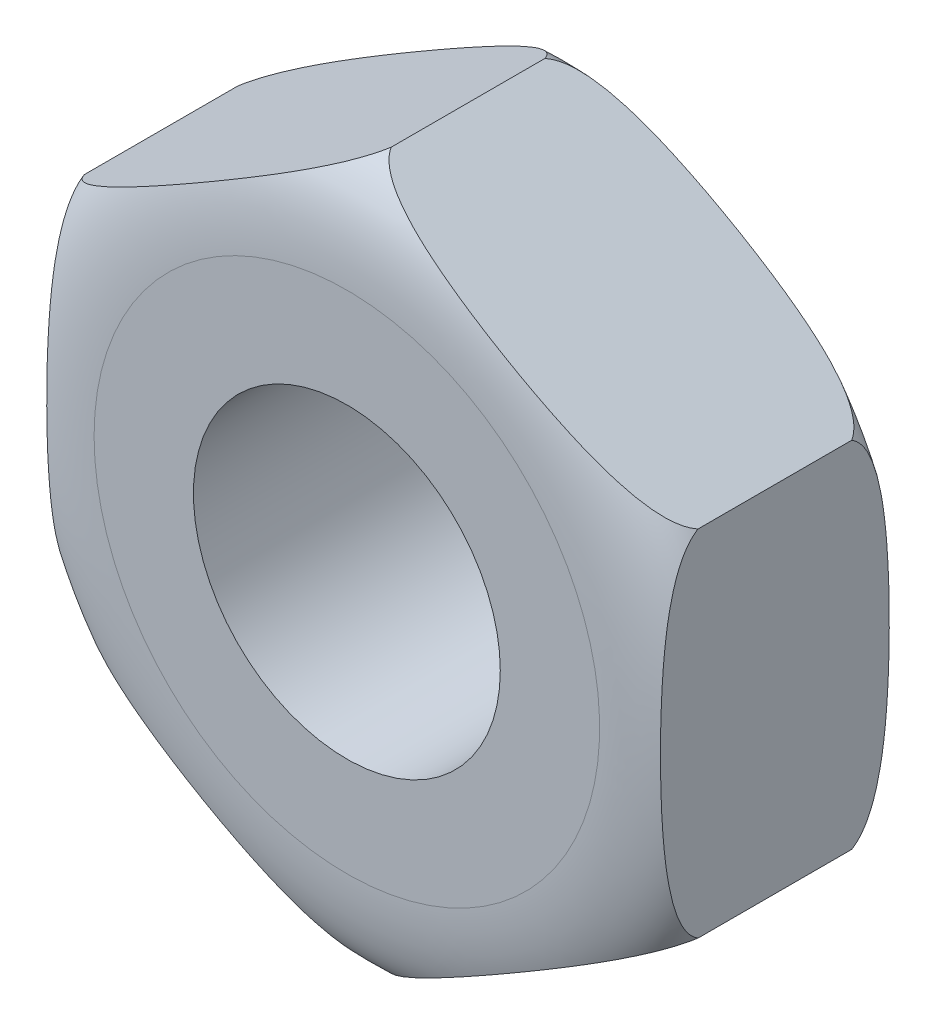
ISO-10303-21;
HEADER;
FILE_DESCRIPTION(('STEP AP214'),'2;1');
FILE_NAME('part.step','',(''),(''),'','','');
FILE_SCHEMA(('AUTOMOTIVE_DESIGN { 1 0 10303 214 1 1 1 1 }'));
ENDSEC;
DATA;
#1=APPLICATION_CONTEXT('core data for automotive mechanical design processes');
#2=APPLICATION_PROTOCOL_DEFINITION('international standard','automotive_design',2000,#1);
#3=PRODUCT_CONTEXT('',#1,'mechanical');
#4=PRODUCT('Part','Part','',(#3));
#5=PRODUCT_RELATED_PRODUCT_CATEGORY('part','',(#4));
#6=PRODUCT_DEFINITION_FORMATION('','',#4);
#7=PRODUCT_DEFINITION_CONTEXT('part definition',#1,'design');
#8=PRODUCT_DEFINITION('design','',#6,#7);
#9=PRODUCT_DEFINITION_SHAPE('','',#8);
#10=(LENGTH_UNIT() NAMED_UNIT(*) SI_UNIT(.MILLI.,.METRE.));
#11=(NAMED_UNIT(*) PLANE_ANGLE_UNIT() SI_UNIT($,.RADIAN.));
#12=(NAMED_UNIT(*) SI_UNIT($,.STERADIAN.) SOLID_ANGLE_UNIT());
#13=UNCERTAINTY_MEASURE_WITH_UNIT(LENGTH_MEASURE(1.E-05),#10,'distance_accuracy_value','');
#14=(GEOMETRIC_REPRESENTATION_CONTEXT(3) GLOBAL_UNCERTAINTY_ASSIGNED_CONTEXT((#13)) GLOBAL_UNIT_ASSIGNED_CONTEXT((#10,
#11,#12)) REPRESENTATION_CONTEXT('',''));
#15=CARTESIAN_POINT('',(0.,0.,0.));
#16=DIRECTION('',(0.,0.,1.));
#17=DIRECTION('',(1.,0.,0.));
#18=AXIS2_PLACEMENT_3D('',#15,#16,#17);
#19=CARTESIAN_POINT('',(-1.9,3.29089653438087,1.5));
#20=DIRECTION('',(0.,0.,1.));
#21=DIRECTION('',(1.,0.,0.));
#22=AXIS2_PLACEMENT_3D('',#19,#20,#21);
#23=PLANE('',#22);
#24=CARTESIAN_POINT('',(0.,0.,1.5));
#25=DIRECTION('',(0.,0.,1.));
#26=DIRECTION('',(1.,0.,0.));
#27=AXIS2_PLACEMENT_3D('',#24,#25,#26);
#28=CIRCLE('',#27,0.95);
#29=CARTESIAN_POINT('',(0.95,0.,1.5));
#30=VERTEX_POINT('',#29);
#31=EDGE_CURVE('E264',#30,#30,#28,.T.);
#32=ORIENTED_EDGE('',*,*,#31,.F.);
#33=EDGE_LOOP('',(#32));
#34=FACE_BOUND('',#33,.T.);
#35=CARTESIAN_POINT('',(0.,0.,1.5));
#36=DIRECTION('',(0.,0.,-1.));
#37=DIRECTION('',(-1.,0.,0.));
#38=AXIS2_PLACEMENT_3D('',#35,#36,#37);
#39=CIRCLE('',#38,1.56505143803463);
#40=CARTESIAN_POINT('',(-1.56505143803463,0.,1.5));
#41=VERTEX_POINT('',#40);
#42=EDGE_CURVE('E204',#41,#41,#39,.T.);
#43=ORIENTED_EDGE('',*,*,#42,.F.);
#44=EDGE_LOOP('',(#43));
#45=FACE_BOUND('',#44,.T.);
#46=ADVANCED_FACE('F49',(#34,#45),#23,.T.);
#47=CARTESIAN_POINT('',(-1.9,3.29089653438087,0.));
#48=DIRECTION('',(0.,0.,1.));
#49=DIRECTION('',(1.,0.,0.));
#50=AXIS2_PLACEMENT_3D('',#47,#48,#49);
#51=PLANE('',#50);
#52=CARTESIAN_POINT('',(0.,0.,0.));
#53=DIRECTION('',(0.,0.,1.));
#54=DIRECTION('',(1.,0.,0.));
#55=AXIS2_PLACEMENT_3D('',#52,#53,#54);
#56=CIRCLE('',#55,0.95);
#57=CARTESIAN_POINT('',(0.95,0.,0.));
#58=VERTEX_POINT('',#57);
#59=EDGE_CURVE('E267',#58,#58,#56,.T.);
#60=ORIENTED_EDGE('',*,*,#59,.T.);
#61=EDGE_LOOP('',(#60));
#62=FACE_BOUND('',#61,.T.);
#63=CARTESIAN_POINT('',(0.,0.,0.));
#64=DIRECTION('',(0.,0.,-1.));
#65=DIRECTION('',(-1.,0.,0.));
#66=AXIS2_PLACEMENT_3D('',#63,#64,#65);
#67=CIRCLE('',#66,1.56505143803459);
#68=CARTESIAN_POINT('',(-1.56505143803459,0.,0.));
#69=VERTEX_POINT('',#68);
#70=EDGE_CURVE('E269',#69,#69,#67,.T.);
#71=ORIENTED_EDGE('',*,*,#70,.T.);
#72=EDGE_LOOP('',(#71));
#73=FACE_BOUND('',#72,.T.);
#74=ADVANCED_FACE('F250',(#62,#73),#51,.F.);
#75=CARTESIAN_POINT('',(0.,0.,1.5));
#76=DIRECTION('',(0.,0.,-1.));
#77=DIRECTION('',(-1.,0.,0.));
#78=AXIS2_PLACEMENT_3D('',#75,#76,#77);
#79=CYLINDRICAL_SURFACE('',#78,0.95);
#80=ORIENTED_EDGE('',*,*,#31,.T.);
#81=EDGE_LOOP('',(#80));
#82=FACE_BOUND('',#81,.T.);
#83=ORIENTED_EDGE('',*,*,#59,.F.);
#84=EDGE_LOOP('',(#83));
#85=FACE_BOUND('',#84,.T.);
#86=ADVANCED_FACE('F157',(#82,#85),#79,.F.);
#87=CARTESIAN_POINT('',(1.31612393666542,-0.759864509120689,1.5));
#88=CARTESIAN_POINT('',(1.54865745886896,-0.894117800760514,1.50318208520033));
#89=CARTESIAN_POINT('',(1.84134953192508,-1.06310364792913,1.45126725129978));
#90=CARTESIAN_POINT('',(1.9,-1.09696551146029,1.22554803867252));
#91=B_SPLINE_CURVE_WITH_KNOTS('',3,(#87,#88,#89,#90),.UNSPECIFIED.,.F.,.F.,(4,4),(0.,1.),.UNSPECIFIED.);
#92=CARTESIAN_POINT('',(0.,0.,0.));
#93=DIRECTION('',(0.,0.,-1.));
#94=AXIS1_PLACEMENT('',#92,#93);
#95=SURFACE_OF_REVOLUTION('',#91,#94);
#96=ORIENTED_EDGE('',*,*,#42,.T.);
#97=EDGE_LOOP('',(#96));
#98=FACE_BOUND('',#97,.T.);
#99=CARTESIAN_POINT('',(-1.9,1.09696551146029,1.22554803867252));
#100=CARTESIAN_POINT('',(-1.89309947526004,1.10094953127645,1.23879320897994));
#101=CARTESIAN_POINT('',(-1.88486263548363,1.10570507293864,1.25087507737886));
#102=CARTESIAN_POINT('',(-1.86669810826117,1.11619236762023,1.27278402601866));
#103=CARTESIAN_POINT('',(-1.85680752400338,1.12190269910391,1.28265136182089));
#104=CARTESIAN_POINT('',(-1.82985805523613,1.13746198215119,1.30601397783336));
#105=CARTESIAN_POINT('',(-1.81200195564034,1.1477712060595,1.31823425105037));
#106=CARTESIAN_POINT('',(-1.78422002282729,1.16381111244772,1.334420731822));
#107=CARTESIAN_POINT('',(-1.77473201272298,1.16928901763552,1.33948310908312));
#108=CARTESIAN_POINT('',(-1.7555227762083,1.1803794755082,1.34897730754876));
#109=CARTESIAN_POINT('',(-1.74580163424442,1.18599197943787,1.35340935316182));
#110=CARTESIAN_POINT('',(-1.7160739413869,1.20315527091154,1.36605534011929));
#111=CARTESIAN_POINT('',(-1.69580840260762,1.21485558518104,1.37345069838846));
#112=CARTESIAN_POINT('',(-1.6548935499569,1.23847778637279,1.3866805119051));
#113=CARTESIAN_POINT('',(-1.63424389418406,1.25039987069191,1.39251349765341));
#114=CARTESIAN_POINT('',(-1.57184811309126,1.28642409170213,1.40829693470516));
#115=CARTESIAN_POINT('',(-1.52977245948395,1.31071648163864,1.41648810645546));
#116=CARTESIAN_POINT('',(-1.44498482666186,1.35966864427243,1.43005022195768));
#117=CARTESIAN_POINT('',(-1.40227044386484,1.38432980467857,1.43539868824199));
#118=CARTESIAN_POINT('',(-1.31679277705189,1.4336803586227,1.44409236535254));
#119=CARTESIAN_POINT('',(-1.27402983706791,1.45836955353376,1.44744220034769));
#120=CARTESIAN_POINT('',(-1.17475914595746,1.51568351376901,1.45353825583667));
#121=CARTESIAN_POINT('',(-1.11822806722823,1.54832174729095,1.45574908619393));
#122=CARTESIAN_POINT('',(-1.00506171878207,1.61365836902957,1.45824920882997));
#123=CARTESIAN_POINT('',(-0.948426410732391,1.64635677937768,1.45853593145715));
#124=CARTESIAN_POINT('',(-0.834986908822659,1.711851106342,1.45724580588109));
#125=CARTESIAN_POINT('',(-0.77818276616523,1.74464699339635,1.45566288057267));
#126=CARTESIAN_POINT('',(-0.665445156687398,1.80973608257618,1.45026116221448));
#127=CARTESIAN_POINT('',(-0.609510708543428,1.84202985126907,1.446474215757));
#128=CARTESIAN_POINT('',(-0.525853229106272,1.89032951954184,1.43835806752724));
#129=CARTESIAN_POINT('',(-0.498042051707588,1.90638631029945,1.43525202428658));
#130=CARTESIAN_POINT('',(-0.442523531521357,1.93843994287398,1.42799646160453));
#131=CARTESIAN_POINT('',(-0.41481617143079,1.9544367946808,1.42384712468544));
#132=CARTESIAN_POINT('',(-0.359688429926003,1.98626481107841,1.41419685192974));
#133=CARTESIAN_POINT('',(-0.332267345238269,2.00209638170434,1.40870136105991));
#134=CARTESIAN_POINT('',(-0.277757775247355,2.03356749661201,1.39585807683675));
#135=CARTESIAN_POINT('',(-0.250669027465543,2.04920719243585,1.38851185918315));
#136=CARTESIAN_POINT('',(-0.214134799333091,2.07030023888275,1.37665326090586));
#137=CARTESIAN_POINT('',(-0.204407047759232,2.07591655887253,1.37330293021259));
#138=CARTESIAN_POINT('',(-0.185066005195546,2.08708311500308,1.36617975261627));
#139=CARTESIAN_POINT('',(-0.175452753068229,2.09263332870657,1.36240676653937));
#140=CARTESIAN_POINT('',(-0.146791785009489,2.10918074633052,1.35033506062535));
#141=CARTESIAN_POINT('',(-0.127962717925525,2.12005171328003,1.34129590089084));
#142=CARTESIAN_POINT('',(-0.0957617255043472,2.13864296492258,1.32289628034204));
#143=CARTESIAN_POINT('',(-0.0821471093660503,2.14650336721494,1.31411038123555));
#144=CARTESIAN_POINT('',(-0.0561817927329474,2.16149444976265,1.2944332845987));
#145=CARTESIAN_POINT('',(-0.0438228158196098,2.16862990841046,1.28355745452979));
#146=CARTESIAN_POINT('',(-0.0263145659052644,2.17873830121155,1.26459186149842));
#147=CARTESIAN_POINT('',(-0.0204159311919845,2.18214387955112,1.25743692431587));
#148=CARTESIAN_POINT('',(-0.00947560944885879,2.18846027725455,1.24219596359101));
#149=CARTESIAN_POINT('',(-0.00444235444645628,2.19136622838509,1.23410193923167));
#150=CARTESIAN_POINT('',(0.,2.19393102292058,1.22554803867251));
#151=B_SPLINE_CURVE_WITH_KNOTS('',3,(#99,#100,#101,#102,#103,#104,#105,#106,#107,#108,#109,#110,
#111,#112,#113,#114,#115,#116,#117,#118,#119,#120,#121,#122,#123,#124,#125,#126,#127,#128,#129,
#130,#131,#132,#133,#134,#135,#136,#137,#138,#139,#140,#141,#142,#143,#144,#145,#146,#147,#148,
#149,#150),.UNSPECIFIED.,.F.,.F.,(4,2,2,2,2,2,2,2,2,2,2,2,2,2,2,2,2,2,2,2,2,2,2,2,2,4),(0.,
0.0459613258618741,0.0910036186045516,0.1625119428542,0.198711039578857,0.23489721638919,
0.308436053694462,0.382043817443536,0.529684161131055,0.678475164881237,0.826920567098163,
1.02282582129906,1.21899265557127,1.41579886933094,1.60982958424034,1.70660791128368,
1.80336931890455,1.89974562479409,1.99604015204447,2.03119717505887,2.06636580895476,
2.13684567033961,2.19076479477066,2.24430165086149,2.27385275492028,2.30367722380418),.UNSPECIFIED.);
#152=CARTESIAN_POINT('',(-1.9,1.09696551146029,1.22554803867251));
#153=VERTEX_POINT('',#152);
#154=CARTESIAN_POINT('',(0.,2.19393102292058,1.22554803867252));
#155=VERTEX_POINT('',#154);
#156=EDGE_CURVE('E107',#153,#155,#151,.T.);
#157=ORIENTED_EDGE('',*,*,#156,.F.);
#158=CARTESIAN_POINT('',(-1.9,-1.09696551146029,1.22554803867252));
#159=CARTESIAN_POINT('',(-1.9,-1.08899747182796,1.23879320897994));
#160=CARTESIAN_POINT('',(-1.9,-1.07948638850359,1.25087507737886));
#161=CARTESIAN_POINT('',(-1.9,-1.05851179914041,1.27278402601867));
#162=CARTESIAN_POINT('',(-1.9,-1.04709113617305,1.28265136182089));
#163=CARTESIAN_POINT('',(-1.9,-1.01597257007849,1.30601397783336));
#164=CARTESIAN_POINT('',(-1.9,-0.995354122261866,1.31823425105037));
#165=CARTESIAN_POINT('',(-1.9,-0.963274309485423,1.33442073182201));
#166=CARTESIAN_POINT('',(-1.9,-0.952318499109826,1.33948310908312));
#167=CARTESIAN_POINT('',(-1.9,-0.930137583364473,1.34897730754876));
#168=CARTESIAN_POINT('',(-1.9,-0.918912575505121,1.35340935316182));
#169=CARTESIAN_POINT('',(-1.89999999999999,-0.884585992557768,1.36605534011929));
#170=CARTESIAN_POINT('',(-1.9,-0.861185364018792,1.37345069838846));
#171=CARTESIAN_POINT('',(-1.9,-0.813940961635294,1.3866805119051));
#172=CARTESIAN_POINT('',(-1.9,-0.790096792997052,1.39251349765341));
#173=CARTESIAN_POINT('',(-1.9,-0.718048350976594,1.40829693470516));
#174=CARTESIAN_POINT('',(-1.9,-0.669463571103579,1.41648810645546));
#175=CARTESIAN_POINT('',(-1.9,-0.571559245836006,1.43005022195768));
#176=CARTESIAN_POINT('',(-1.90000000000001,-0.522236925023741,1.43539868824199));
#177=CARTESIAN_POINT('',(-1.89999999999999,-0.423535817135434,1.44409236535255));
#178=CARTESIAN_POINT('',(-1.89999999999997,-0.374157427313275,1.44744220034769));
#179=CARTESIAN_POINT('',(-1.89999999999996,-0.259529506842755,1.45353825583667));
#180=CARTESIAN_POINT('',(-1.89999999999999,-0.194253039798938,1.45574908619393));
#181=CARTESIAN_POINT('',(-1.90000000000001,-0.0635797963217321,1.45824920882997));
#182=CARTESIAN_POINT('',(-1.9,0.00181702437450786,1.45853593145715));
#183=CARTESIAN_POINT('',(-1.9,0.132805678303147,1.45724580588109));
#184=CARTESIAN_POINT('',(-1.9,0.198397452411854,1.45566288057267));
#185=CARTESIAN_POINT('',(-1.9,0.328575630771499,1.45026116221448));
#186=CARTESIAN_POINT('',(-1.9,0.393163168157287,1.446474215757));
#187=CARTESIAN_POINT('',(-1.9,0.489762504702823,1.43835806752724));
#188=CARTESIAN_POINT('',(-1.9,0.521876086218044,1.43525202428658));
#189=CARTESIAN_POINT('',(-1.9,0.585983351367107,1.42799646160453));
#190=CARTESIAN_POINT('',(-1.9,0.617977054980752,1.42384712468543));
#191=CARTESIAN_POINT('',(-1.9,0.681633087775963,1.41419685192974));
#192=CARTESIAN_POINT('',(-1.9,0.713296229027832,1.40870136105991));
#193=CARTESIAN_POINT('',(-1.9,0.776238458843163,1.39585807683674));
#194=CARTESIAN_POINT('',(-1.9,0.807517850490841,1.38851185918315));
#195=CARTESIAN_POINT('',(-1.9,0.849703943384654,1.37665326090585));
#196=CARTESIAN_POINT('',(-1.9,0.860936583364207,1.37330293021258));
#197=CARTESIAN_POINT('',(-1.9,0.88326969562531,1.36617975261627));
#198=CARTESIAN_POINT('',(-1.9,0.894370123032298,1.36240676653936));
#199=CARTESIAN_POINT('',(-1.9,0.927464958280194,1.35033506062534));
#200=CARTESIAN_POINT('',(-1.89999999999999,0.949206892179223,1.34129590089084));
#201=CARTESIAN_POINT('',(-1.9,0.986389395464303,1.32289628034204));
#202=CARTESIAN_POINT('',(-1.9,1.00211020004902,1.31411038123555));
#203=CARTESIAN_POINT('',(-1.9,1.03209236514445,1.29443328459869));
#204=CARTESIAN_POINT('',(-1.89999999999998,1.04636328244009,1.28355745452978));
#205=CARTESIAN_POINT('',(-1.89999999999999,1.06658006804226,1.26459186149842));
#206=CARTESIAN_POINT('',(-1.9,1.07339122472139,1.25743692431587));
#207=CARTESIAN_POINT('',(-1.90000000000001,1.08602402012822,1.24219596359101));
#208=CARTESIAN_POINT('',(-1.90000000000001,1.0918359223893,1.23410193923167));
#209=CARTESIAN_POINT('',(-1.9,1.09696551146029,1.22554803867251));
#210=B_SPLINE_CURVE_WITH_KNOTS('',3,(#158,#159,#160,#161,#162,#163,#164,#165,#166,#167,#168,
#169,#170,#171,#172,#173,#174,#175,#176,#177,#178,#179,#180,#181,#182,#183,#184,#185,#186,#187,
#188,#189,#190,#191,#192,#193,#194,#195,#196,#197,#198,#199,#200,#201,#202,#203,#204,#205,#206,
#207,#208,#209),.UNSPECIFIED.,.F.,.F.,(4,2,2,2,2,2,2,2,2,2,2,2,2,2,2,2,2,2,2,2,2,2,2,2,2,4),(0.,
0.0459613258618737,0.0910036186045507,0.1625119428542,0.198711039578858,0.234897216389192,
0.308436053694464,0.38204381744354,0.529684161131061,0.678475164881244,0.826920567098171,
1.02282582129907,1.21899265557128,1.41579886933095,1.60982958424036,1.70660791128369,
1.80336931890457,1.89974562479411,1.99604015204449,2.03119717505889,2.06636580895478,
2.13684567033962,2.19076479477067,2.2443016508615,2.27385275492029,2.30367722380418),.UNSPECIFIED.);
#211=CARTESIAN_POINT('',(-1.9,-1.09696551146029,1.22554803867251));
#212=VERTEX_POINT('',#211);
#213=EDGE_CURVE('E110',#212,#153,#210,.T.);
#214=ORIENTED_EDGE('',*,*,#213,.F.);
#215=CARTESIAN_POINT('',(0.,-2.19393102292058,1.22554803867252));
#216=CARTESIAN_POINT('',(-0.00690052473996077,-2.18994700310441,1.23879320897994));
#217=CARTESIAN_POINT('',(-0.0151373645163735,-2.18519146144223,1.25087507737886));
#218=CARTESIAN_POINT('',(-0.0333018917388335,-2.17470416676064,1.27278402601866));
#219=CARTESIAN_POINT('',(-0.0431924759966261,-2.16899383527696,1.28265136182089));
#220=CARTESIAN_POINT('',(-0.0701419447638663,-2.15343455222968,1.30601397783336));
#221=CARTESIAN_POINT('',(-0.0879980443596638,-2.14312532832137,1.31823425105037));
#222=CARTESIAN_POINT('',(-0.115779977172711,-2.12708542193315,1.33442073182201));
#223=CARTESIAN_POINT('',(-0.125267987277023,-2.12160751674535,1.33948310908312));
#224=CARTESIAN_POINT('',(-0.1444772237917,-2.11051705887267,1.34897730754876));
#225=CARTESIAN_POINT('',(-0.154198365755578,-2.10490455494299,1.35340935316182));
#226=CARTESIAN_POINT('',(-0.183926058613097,-2.08774126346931,1.36605534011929));
#227=CARTESIAN_POINT('',(-0.204191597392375,-2.07604094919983,1.37345069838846));
#228=CARTESIAN_POINT('',(-0.245106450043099,-2.05241874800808,1.3866805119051));
#229=CARTESIAN_POINT('',(-0.265756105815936,-2.04049666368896,1.39251349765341));
#230=CARTESIAN_POINT('',(-0.328151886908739,-2.00447244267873,1.40829693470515));
#231=CARTESIAN_POINT('',(-0.370227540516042,-1.98018005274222,1.41648810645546));
#232=CARTESIAN_POINT('',(-0.455015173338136,-1.93122789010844,1.43005022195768));
#233=CARTESIAN_POINT('',(-0.497729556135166,-1.90656672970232,1.43539868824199));
#234=CARTESIAN_POINT('',(-0.583207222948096,-1.85721617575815,1.44409236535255));
#235=CARTESIAN_POINT('',(-0.625970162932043,-1.83252698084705,1.44744220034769));
#236=CARTESIAN_POINT('',(-0.725240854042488,-1.77521302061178,1.45353825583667));
#237=CARTESIAN_POINT('',(-0.781771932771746,-1.7425747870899,1.45574908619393));
#238=CARTESIAN_POINT('',(-0.894938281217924,-1.67723816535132,1.45824920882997));
#239=CARTESIAN_POINT('',(-0.951573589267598,-1.6445397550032,1.45853593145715));
#240=CARTESIAN_POINT('',(-1.06501309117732,-1.57904542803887,1.45724580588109));
#241=CARTESIAN_POINT('',(-1.12181723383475,-1.54624954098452,1.45566288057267));
#242=CARTESIAN_POINT('',(-1.23455484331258,-1.4811604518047,1.45026116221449));
#243=CARTESIAN_POINT('',(-1.29048929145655,-1.44886668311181,1.446474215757));
#244=CARTESIAN_POINT('',(-1.3741467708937,-1.40056701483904,1.43835806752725));
#245=CARTESIAN_POINT('',(-1.40195794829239,-1.38451022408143,1.43525202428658));
#246=CARTESIAN_POINT('',(-1.45747646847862,-1.3524565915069,1.42799646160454));
#247=CARTESIAN_POINT('',(-1.48518382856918,-1.33645973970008,1.42384712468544));
#248=CARTESIAN_POINT('',(-1.54031157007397,-1.30463172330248,1.41419685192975));
#249=CARTESIAN_POINT('',(-1.5677326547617,-1.28880015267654,1.40870136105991));
#250=CARTESIAN_POINT('',(-1.62224222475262,-1.25732903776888,1.39585807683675));
#251=CARTESIAN_POINT('',(-1.64933097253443,-1.24168934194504,1.38851185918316));
#252=CARTESIAN_POINT('',(-1.68586520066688,-1.22059629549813,1.37665326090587));
#253=CARTESIAN_POINT('',(-1.69559295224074,-1.21497997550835,1.3733029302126));
#254=CARTESIAN_POINT('',(-1.71493399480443,-1.2038134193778,1.36617975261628));
#255=CARTESIAN_POINT('',(-1.72454724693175,-1.19826320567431,1.36240676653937));
#256=CARTESIAN_POINT('',(-1.75320821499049,-1.18171578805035,1.35033506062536));
#257=CARTESIAN_POINT('',(-1.77203728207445,-1.17084482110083,1.34129590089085));
#258=CARTESIAN_POINT('',(-1.80423827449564,-1.15225356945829,1.32289628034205));
#259=CARTESIAN_POINT('',(-1.81785289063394,-1.14439316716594,1.31411038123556));
#260=CARTESIAN_POINT('',(-1.84381820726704,-1.12940208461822,1.29443328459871));
#261=CARTESIAN_POINT('',(-1.85617718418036,-1.12226662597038,1.2835574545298));
#262=CARTESIAN_POINT('',(-1.87368543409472,-1.1121582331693,1.26459186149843));
#263=CARTESIAN_POINT('',(-1.879584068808,-1.10875265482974,1.25743692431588));
#264=CARTESIAN_POINT('',(-1.89052439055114,-1.10243625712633,1.24219596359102));
#265=CARTESIAN_POINT('',(-1.89555764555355,-1.09953030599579,1.23410193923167));
#266=CARTESIAN_POINT('',(-1.9,-1.09696551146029,1.22554803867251));
#267=B_SPLINE_CURVE_WITH_KNOTS('',3,(#215,#216,#217,#218,#219,#220,#221,#222,#223,#224,#225,
#226,#227,#228,#229,#230,#231,#232,#233,#234,#235,#236,#237,#238,#239,#240,#241,#242,#243,#244,
#245,#246,#247,#248,#249,#250,#251,#252,#253,#254,#255,#256,#257,#258,#259,#260,#261,#262,#263,
#264,#265,#266),.UNSPECIFIED.,.F.,.F.,(4,2,2,2,2,2,2,2,2,2,2,2,2,2,2,2,2,2,2,2,2,2,2,2,2,4),(0.,
0.0459613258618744,0.0910036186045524,0.162511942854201,0.198711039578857,0.23489721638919,
0.308436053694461,0.382043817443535,0.529684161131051,0.67847516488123,0.826920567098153,
1.02282582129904,1.21899265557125,1.41579886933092,1.60982958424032,1.70660791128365,
1.80336931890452,1.89974562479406,1.99604015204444,2.03119717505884,2.06636580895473,
2.13684567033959,2.19076479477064,2.24430165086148,2.27385275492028,2.30367722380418),.UNSPECIFIED.);
#268=CARTESIAN_POINT('',(0.,-2.19393102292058,1.22554803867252));
#269=VERTEX_POINT('',#268);
#270=EDGE_CURVE('E129',#269,#212,#267,.T.);
#271=ORIENTED_EDGE('',*,*,#270,.F.);
#272=CARTESIAN_POINT('',(1.9,-1.09696551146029,1.22554803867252));
#273=CARTESIAN_POINT('',(1.89309947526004,-1.10094953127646,1.23879320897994));
#274=CARTESIAN_POINT('',(1.88486263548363,-1.10570507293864,1.25087507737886));
#275=CARTESIAN_POINT('',(1.86669810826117,-1.11619236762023,1.27278402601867));
#276=CARTESIAN_POINT('',(1.85680752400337,-1.12190269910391,1.28265136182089));
#277=CARTESIAN_POINT('',(1.82985805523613,-1.13746198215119,1.30601397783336));
#278=CARTESIAN_POINT('',(1.81200195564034,-1.1477712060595,1.31823425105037));
#279=CARTESIAN_POINT('',(1.78422002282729,-1.16381111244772,1.33442073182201));
#280=CARTESIAN_POINT('',(1.77473201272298,-1.16928901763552,1.33948310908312));
#281=CARTESIAN_POINT('',(1.7555227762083,-1.1803794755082,1.34897730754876));
#282=CARTESIAN_POINT('',(1.74580163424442,-1.18599197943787,1.35340935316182));
#283=CARTESIAN_POINT('',(1.7160739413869,-1.20315527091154,1.36605534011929));
#284=CARTESIAN_POINT('',(1.69580840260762,-1.21485558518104,1.37345069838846));
#285=CARTESIAN_POINT('',(1.6548935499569,-1.23847778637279,1.3866805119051));
#286=CARTESIAN_POINT('',(1.63424389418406,-1.25039987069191,1.39251349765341));
#287=CARTESIAN_POINT('',(1.57184811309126,-1.28642409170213,1.40829693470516));
#288=CARTESIAN_POINT('',(1.52977245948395,-1.31071648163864,1.41648810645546));
#289=CARTESIAN_POINT('',(1.44498482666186,-1.35966864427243,1.43005022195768));
#290=CARTESIAN_POINT('',(1.40227044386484,-1.38432980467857,1.43539868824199));
#291=CARTESIAN_POINT('',(1.31679277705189,-1.4336803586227,1.44409236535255));
#292=CARTESIAN_POINT('',(1.27402983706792,-1.45836955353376,1.44744220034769));
#293=CARTESIAN_POINT('',(1.17475914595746,-1.51568351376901,1.45353825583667));
#294=CARTESIAN_POINT('',(1.11822806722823,-1.54832174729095,1.45574908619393));
#295=CARTESIAN_POINT('',(1.00506171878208,-1.61365836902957,1.45824920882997));
#296=CARTESIAN_POINT('',(0.948426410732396,-1.64635677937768,1.45853593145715));
#297=CARTESIAN_POINT('',(0.834986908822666,-1.71185110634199,1.45724580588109));
#298=CARTESIAN_POINT('',(0.778182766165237,-1.74464699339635,1.45566288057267));
#299=CARTESIAN_POINT('',(0.665445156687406,-1.80973608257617,1.45026116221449));
#300=CARTESIAN_POINT('',(0.609510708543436,-1.84202985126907,1.446474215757));
#301=CARTESIAN_POINT('',(0.525853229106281,-1.89032951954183,1.43835806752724));
#302=CARTESIAN_POINT('',(0.498042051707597,-1.90638631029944,1.43525202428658));
#303=CARTESIAN_POINT('',(0.442523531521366,-1.93843994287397,1.42799646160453));
#304=CARTESIAN_POINT('',(0.4148161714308,-1.9544367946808,1.42384712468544));
#305=CARTESIAN_POINT('',(0.359688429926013,-1.9862648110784,1.41419685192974));
#306=CARTESIAN_POINT('',(0.33226734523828,-2.00209638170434,1.40870136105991));
#307=CARTESIAN_POINT('',(0.277757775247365,-2.033567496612,1.39585807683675));
#308=CARTESIAN_POINT('',(0.250669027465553,-2.04920719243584,1.38851185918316));
#309=CARTESIAN_POINT('',(0.2141347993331,-2.07030023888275,1.37665326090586));
#310=CARTESIAN_POINT('',(0.204407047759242,-2.07591655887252,1.37330293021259));
#311=CARTESIAN_POINT('',(0.185066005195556,-2.08708311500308,1.36617975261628));
#312=CARTESIAN_POINT('',(0.175452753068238,-2.09263332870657,1.36240676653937));
#313=CARTESIAN_POINT('',(0.146791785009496,-2.10918074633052,1.35033506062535));
#314=CARTESIAN_POINT('',(0.127962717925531,-2.12005171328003,1.34129590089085));
#315=CARTESIAN_POINT('',(0.0957617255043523,-2.13864296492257,1.32289628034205));
#316=CARTESIAN_POINT('',(0.0821471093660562,-2.14650336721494,1.31411038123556));
#317=CARTESIAN_POINT('',(0.056181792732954,-2.16149444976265,1.2944332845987));
#318=CARTESIAN_POINT('',(0.0438228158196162,-2.16862990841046,1.28355745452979));
#319=CARTESIAN_POINT('',(0.0263145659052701,-2.17873830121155,1.26459186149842));
#320=CARTESIAN_POINT('',(0.0204159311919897,-2.18214387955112,1.25743692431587));
#321=CARTESIAN_POINT('',(0.00947560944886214,-2.18846027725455,1.24219596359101));
#322=CARTESIAN_POINT('',(0.00444235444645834,-2.19136622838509,1.23410193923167));
#323=CARTESIAN_POINT('',(0.,-2.19393102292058,1.22554803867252));
#324=B_SPLINE_CURVE_WITH_KNOTS('',3,(#272,#273,#274,#275,#276,#277,#278,#279,#280,#281,#282,
#283,#284,#285,#286,#287,#288,#289,#290,#291,#292,#293,#294,#295,#296,#297,#298,#299,#300,#301,
#302,#303,#304,#305,#306,#307,#308,#309,#310,#311,#312,#313,#314,#315,#316,#317,#318,#319,#320,
#321,#322,#323),.UNSPECIFIED.,.F.,.F.,(4,2,2,2,2,2,2,2,2,2,2,2,2,2,2,2,2,2,2,2,2,2,2,2,2,4),(0.,
0.0459613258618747,0.0910036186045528,0.162511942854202,0.198711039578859,0.234897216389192,
0.308436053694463,0.382043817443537,0.529684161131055,0.678475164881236,0.826920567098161,
1.02282582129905,1.21899265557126,1.41579886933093,1.60982958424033,1.70660791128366,
1.80336931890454,1.89974562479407,1.99604015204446,2.03119717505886,2.06636580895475,
2.1368456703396,2.19076479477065,2.24430165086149,2.27385275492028,2.30367722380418),.UNSPECIFIED.);
#325=CARTESIAN_POINT('',(1.9,-1.09696551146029,1.22554803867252));
#326=VERTEX_POINT('',#325);
#327=EDGE_CURVE('E72',#326,#269,#324,.T.);
#328=ORIENTED_EDGE('',*,*,#327,.F.);
#329=CARTESIAN_POINT('',(1.9,1.09696551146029,1.22554803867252));
#330=CARTESIAN_POINT('',(1.9,1.08899747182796,1.23879320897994));
#331=CARTESIAN_POINT('',(1.9,1.07948638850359,1.25087507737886));
#332=CARTESIAN_POINT('',(1.9,1.05851179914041,1.27278402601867));
#333=CARTESIAN_POINT('',(1.9,1.04709113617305,1.28265136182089));
#334=CARTESIAN_POINT('',(1.9,1.01597257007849,1.30601397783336));
#335=CARTESIAN_POINT('',(1.9,0.995354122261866,1.31823425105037));
#336=CARTESIAN_POINT('',(1.9,0.963274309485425,1.33442073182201));
#337=CARTESIAN_POINT('',(1.9,0.952318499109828,1.33948310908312));
#338=CARTESIAN_POINT('',(1.9,0.930137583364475,1.34897730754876));
#339=CARTESIAN_POINT('',(1.89999999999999,0.918912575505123,1.35340935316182));
#340=CARTESIAN_POINT('',(1.89999999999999,0.884585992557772,1.36605534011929));
#341=CARTESIAN_POINT('',(1.9,0.861185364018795,1.37345069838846));
#342=CARTESIAN_POINT('',(1.9,0.813940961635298,1.3866805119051));
#343=CARTESIAN_POINT('',(1.9,0.790096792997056,1.39251349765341));
#344=CARTESIAN_POINT('',(1.9,0.7180483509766,1.40829693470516));
#345=CARTESIAN_POINT('',(1.9,0.669463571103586,1.41648810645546));
#346=CARTESIAN_POINT('',(1.9,0.571559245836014,1.43005022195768));
#347=CARTESIAN_POINT('',(1.90000000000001,0.52223692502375,1.43539868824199));
#348=CARTESIAN_POINT('',(1.89999999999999,0.423535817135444,1.44409236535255));
#349=CARTESIAN_POINT('',(1.89999999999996,0.374157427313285,1.44744220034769));
#350=CARTESIAN_POINT('',(1.89999999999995,0.259529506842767,1.45353825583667));
#351=CARTESIAN_POINT('',(1.89999999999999,0.19425303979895,1.45574908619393));
#352=CARTESIAN_POINT('',(1.90000000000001,0.0635797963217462,1.45824920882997));
#353=CARTESIAN_POINT('',(1.9,-0.00181702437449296,1.45853593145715));
#354=CARTESIAN_POINT('',(1.9,-0.13280567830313,1.45724580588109));
#355=CARTESIAN_POINT('',(1.9,-0.198397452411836,1.45566288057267));
#356=CARTESIAN_POINT('',(1.9,-0.32857563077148,1.45026116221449));
#357=CARTESIAN_POINT('',(1.9,-0.393163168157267,1.446474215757));
#358=CARTESIAN_POINT('',(1.9,-0.489762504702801,1.43835806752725));
#359=CARTESIAN_POINT('',(1.9,-0.521876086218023,1.43525202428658));
#360=CARTESIAN_POINT('',(1.9,-0.585983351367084,1.42799646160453));
#361=CARTESIAN_POINT('',(1.9,-0.617977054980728,1.42384712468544));
#362=CARTESIAN_POINT('',(1.9,-0.681633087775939,1.41419685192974));
#363=CARTESIAN_POINT('',(1.9,-0.713296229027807,1.40870136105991));
#364=CARTESIAN_POINT('',(1.9,-0.776238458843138,1.39585807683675));
#365=CARTESIAN_POINT('',(1.9,-0.807517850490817,1.38851185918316));
#366=CARTESIAN_POINT('',(1.9,-0.849703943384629,1.37665326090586));
#367=CARTESIAN_POINT('',(1.9,-0.860936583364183,1.37330293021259));
#368=CARTESIAN_POINT('',(1.9,-0.883269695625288,1.36617975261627));
#369=CARTESIAN_POINT('',(1.9,-0.894370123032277,1.36240676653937));
#370=CARTESIAN_POINT('',(1.9,-0.927464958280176,1.35033506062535));
#371=CARTESIAN_POINT('',(1.89999999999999,-0.949206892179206,1.34129590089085));
#372=CARTESIAN_POINT('',(1.9,-0.986389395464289,1.32289628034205));
#373=CARTESIAN_POINT('',(1.9,-1.00211020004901,1.31411038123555));
#374=CARTESIAN_POINT('',(1.9,-1.03209236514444,1.2944332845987));
#375=CARTESIAN_POINT('',(1.89999999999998,-1.04636328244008,1.28355745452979));
#376=CARTESIAN_POINT('',(1.89999999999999,-1.06658006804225,1.26459186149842));
#377=CARTESIAN_POINT('',(1.89999999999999,-1.07339122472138,1.25743692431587));
#378=CARTESIAN_POINT('',(1.9,-1.08602402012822,1.24219596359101));
#379=CARTESIAN_POINT('',(1.90000000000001,-1.0918359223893,1.23410193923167));
#380=CARTESIAN_POINT('',(1.9,-1.09696551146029,1.22554803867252));
#381=B_SPLINE_CURVE_WITH_KNOTS('',3,(#329,#330,#331,#332,#333,#334,#335,#336,#337,#338,#339,
#340,#341,#342,#343,#344,#345,#346,#347,#348,#349,#350,#351,#352,#353,#354,#355,#356,#357,#358,
#359,#360,#361,#362,#363,#364,#365,#366,#367,#368,#369,#370,#371,#372,#373,#374,#375,#376,#377,
#378,#379,#380),.UNSPECIFIED.,.F.,.F.,(4,2,2,2,2,2,2,2,2,2,2,2,2,2,2,2,2,2,2,2,2,2,2,2,2,4),(0.,
0.0459613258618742,0.0910036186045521,0.1625119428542,0.198711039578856,0.234897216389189,
0.308436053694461,0.382043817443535,0.529684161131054,0.678475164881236,0.826920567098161,
1.02282582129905,1.21899265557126,1.41579886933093,1.60982958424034,1.70660791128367,
1.80336931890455,1.89974562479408,1.99604015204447,2.03119717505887,2.06636580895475,
2.13684567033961,2.19076479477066,2.24430165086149,2.27385275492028,2.30367722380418),.UNSPECIFIED.);
#382=CARTESIAN_POINT('',(1.9,1.09696551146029,1.22554803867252));
#383=VERTEX_POINT('',#382);
#384=EDGE_CURVE('E65',#383,#326,#381,.T.);
#385=ORIENTED_EDGE('',*,*,#384,.F.);
#386=CARTESIAN_POINT('',(0.,2.19393102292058,1.22554803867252));
#387=CARTESIAN_POINT('',(0.00690052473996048,2.18994700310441,1.23879320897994));
#388=CARTESIAN_POINT('',(0.0151373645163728,2.18519146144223,1.25087507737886));
#389=CARTESIAN_POINT('',(0.0333018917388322,2.17470416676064,1.27278402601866));
#390=CARTESIAN_POINT('',(0.0431924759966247,2.16899383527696,1.28265136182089));
#391=CARTESIAN_POINT('',(0.0701419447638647,2.15343455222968,1.30601397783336));
#392=CARTESIAN_POINT('',(0.0879980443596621,2.14312532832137,1.31823425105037));
#393=CARTESIAN_POINT('',(0.115779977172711,2.12708542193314,1.33442073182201));
#394=CARTESIAN_POINT('',(0.125267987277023,2.12160751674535,1.33948310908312));
#395=CARTESIAN_POINT('',(0.144477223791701,2.11051705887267,1.34897730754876));
#396=CARTESIAN_POINT('',(0.154198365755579,2.10490455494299,1.35340935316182));
#397=CARTESIAN_POINT('',(0.183926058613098,2.08774126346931,1.36605534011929));
#398=CARTESIAN_POINT('',(0.204191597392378,2.07604094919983,1.37345069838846));
#399=CARTESIAN_POINT('',(0.245106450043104,2.05241874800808,1.3866805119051));
#400=CARTESIAN_POINT('',(0.265756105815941,2.04049666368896,1.39251349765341));
#401=CARTESIAN_POINT('',(0.328151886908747,2.00447244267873,1.40829693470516));
#402=CARTESIAN_POINT('',(0.370227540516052,1.98018005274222,1.41648810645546));
#403=CARTESIAN_POINT('',(0.455015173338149,1.93122789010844,1.43005022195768));
#404=CARTESIAN_POINT('',(0.497729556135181,1.90656672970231,1.43539868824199));
#405=CARTESIAN_POINT('',(0.583207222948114,1.85721617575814,1.44409236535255));
#406=CARTESIAN_POINT('',(0.625970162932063,1.83252698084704,1.44744220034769));
#407=CARTESIAN_POINT('',(0.725240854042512,1.77521302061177,1.45353825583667));
#408=CARTESIAN_POINT('',(0.781771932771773,1.74257478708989,1.45574908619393));
#409=CARTESIAN_POINT('',(0.894938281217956,1.6772381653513,1.45824920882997));
#410=CARTESIAN_POINT('',(0.951573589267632,1.64453975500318,1.45853593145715));
#411=CARTESIAN_POINT('',(1.06501309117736,1.57904542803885,1.45724580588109));
#412=CARTESIAN_POINT('',(1.12181723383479,1.5462495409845,1.45566288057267));
#413=CARTESIAN_POINT('',(1.23455484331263,1.48116045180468,1.45026116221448));
#414=CARTESIAN_POINT('',(1.2904892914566,1.44886668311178,1.446474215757));
#415=CARTESIAN_POINT('',(1.37414677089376,1.40056701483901,1.43835806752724));
#416=CARTESIAN_POINT('',(1.40195794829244,1.3845102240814,1.43525202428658));
#417=CARTESIAN_POINT('',(1.45747646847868,1.35245659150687,1.42799646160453));
#418=CARTESIAN_POINT('',(1.48518382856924,1.33645973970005,1.42384712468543));
#419=CARTESIAN_POINT('',(1.54031157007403,1.30463172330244,1.41419685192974));
#420=CARTESIAN_POINT('',(1.56773265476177,1.28880015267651,1.4087013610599));
#421=CARTESIAN_POINT('',(1.62224222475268,1.25732903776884,1.39585807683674));
#422=CARTESIAN_POINT('',(1.64933097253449,1.241689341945,1.38851185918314));
#423=CARTESIAN_POINT('',(1.68586520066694,1.22059629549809,1.37665326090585));
#424=CARTESIAN_POINT('',(1.6955929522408,1.21497997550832,1.37330293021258));
#425=CARTESIAN_POINT('',(1.71493399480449,1.20381341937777,1.36617975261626));
#426=CARTESIAN_POINT('',(1.7245472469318,1.19826320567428,1.36240676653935));
#427=CARTESIAN_POINT('',(1.75320821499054,1.18171578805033,1.35033506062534));
#428=CARTESIAN_POINT('',(1.77203728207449,1.17084482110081,1.34129590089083));
#429=CARTESIAN_POINT('',(1.80423827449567,1.15225356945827,1.32289628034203));
#430=CARTESIAN_POINT('',(1.81785289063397,1.14439316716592,1.31411038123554));
#431=CARTESIAN_POINT('',(1.84381820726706,1.1294020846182,1.29443328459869));
#432=CARTESIAN_POINT('',(1.85617718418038,1.12226662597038,1.28355745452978));
#433=CARTESIAN_POINT('',(1.87368543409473,1.11215823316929,1.26459186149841));
#434=CARTESIAN_POINT('',(1.87958406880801,1.10875265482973,1.25743692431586));
#435=CARTESIAN_POINT('',(1.89052439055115,1.10243625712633,1.24219596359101));
#436=CARTESIAN_POINT('',(1.89555764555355,1.09953030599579,1.23410193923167));
#437=CARTESIAN_POINT('',(1.9,1.09696551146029,1.22554803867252));
#438=B_SPLINE_CURVE_WITH_KNOTS('',3,(#386,#387,#388,#389,#390,#391,#392,#393,#394,#395,#396,
#397,#398,#399,#400,#401,#402,#403,#404,#405,#406,#407,#408,#409,#410,#411,#412,#413,#414,#415,
#416,#417,#418,#419,#420,#421,#422,#423,#424,#425,#426,#427,#428,#429,#430,#431,#432,#433,#434,
#435,#436,#437),.UNSPECIFIED.,.F.,.F.,(4,2,2,2,2,2,2,2,2,2,2,2,2,2,2,2,2,2,2,2,2,2,2,2,2,4),(0.,
0.0459613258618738,0.0910036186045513,0.162511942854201,0.198711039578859,0.234897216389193,
0.308436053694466,0.382043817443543,0.529684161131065,0.67847516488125,0.826920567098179,
1.02282582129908,1.21899265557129,1.41579886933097,1.60982958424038,1.70660791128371,
1.80336931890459,1.89974562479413,1.99604015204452,2.03119717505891,2.0663658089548,
2.13684567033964,2.19076479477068,2.2443016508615,2.27385275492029,2.30367722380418),.UNSPECIFIED.);
#439=EDGE_CURVE('E113',#155,#383,#438,.T.);
#440=ORIENTED_EDGE('',*,*,#439,.F.);
#441=EDGE_LOOP('',(#157,#214,#271,#328,#385,#440));
#442=FACE_BOUND('',#441,.T.);
#443=ADVANCED_FACE('F109',(#98,#442),#95,.T.);
#444=CARTESIAN_POINT('',(1.9,-1.09696551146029,0.274451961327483));
#445=CARTESIAN_POINT('',(1.84134953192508,-1.06310364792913,0.048732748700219));
#446=CARTESIAN_POINT('',(1.54865745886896,-0.894117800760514,-0.00318208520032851));
#447=CARTESIAN_POINT('',(1.31612393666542,-0.759864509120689,0.));
#448=B_SPLINE_CURVE_WITH_KNOTS('',3,(#444,#445,#446,#447),.UNSPECIFIED.,.F.,.F.,(4,4),(0.,1.),.UNSPECIFIED.);
#449=CARTESIAN_POINT('',(0.,0.,0.));
#450=DIRECTION('',(0.,0.,-1.));
#451=AXIS1_PLACEMENT('',#449,#450);
#452=SURFACE_OF_REVOLUTION('',#448,#451);
#453=CARTESIAN_POINT('',(1.9,-1.09696551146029,0.27445196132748));
#454=CARTESIAN_POINT('',(1.9,-1.0888987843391,0.261049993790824));
#455=CARTESIAN_POINT('',(1.9,-1.07925030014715,0.248829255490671));
#456=CARTESIAN_POINT('',(1.9,-1.05796450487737,0.226694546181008));
#457=CARTESIAN_POINT('',(1.9,-1.04637118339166,0.216739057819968));
#458=CARTESIAN_POINT('',(1.9,-1.02449544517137,0.200444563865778));
#459=CARTESIAN_POINT('',(1.9,-1.01443882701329,0.193783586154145));
#460=CARTESIAN_POINT('',(1.9,-0.993783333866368,0.181353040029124));
#461=CARTESIAN_POINT('',(1.9,-0.983184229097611,0.175583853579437));
#462=CARTESIAN_POINT('',(1.9,-0.961498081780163,0.164731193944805));
#463=CARTESIAN_POINT('',(1.9,-0.950406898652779,0.159656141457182));
#464=CARTESIAN_POINT('',(1.9,-0.927962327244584,0.15014264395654));
#465=CARTESIAN_POINT('',(1.9,-0.916609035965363,0.145703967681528));
#466=CARTESIAN_POINT('',(1.89999999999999,-0.881716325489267,0.132980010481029));
#467=CARTESIAN_POINT('',(1.9,-0.85787061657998,0.125536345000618));
#468=CARTESIAN_POINT('',(1.9,-0.809733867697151,0.112239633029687));
#469=CARTESIAN_POINT('',(1.9,-0.785442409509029,0.106388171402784));
#470=CARTESIAN_POINT('',(1.9,-0.712047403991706,0.0905772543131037));
#471=CARTESIAN_POINT('',(1.9,-0.662563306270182,0.0824059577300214));
#472=CARTESIAN_POINT('',(1.9,-0.562805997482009,0.0689116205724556));
#473=CARTESIAN_POINT('',(1.90000000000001,-0.512529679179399,0.0636144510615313));
#474=CARTESIAN_POINT('',(1.89999999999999,-0.411936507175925,0.0550484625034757));
#475=CARTESIAN_POINT('',(1.89999999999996,-0.361620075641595,0.0517745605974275));
#476=CARTESIAN_POINT('',(1.89999999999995,-0.244693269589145,0.045869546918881));
#477=CARTESIAN_POINT('',(1.89999999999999,-0.178056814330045,0.043785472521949));
#478=CARTESIAN_POINT('',(1.90000000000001,-0.0446528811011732,0.041591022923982));
#479=CARTESIAN_POINT('',(1.9,0.0221146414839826,0.0414836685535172));
#480=CARTESIAN_POINT('',(1.9,0.155912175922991,0.0432327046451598));
#481=CARTESIAN_POINT('',(1.9,0.222942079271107,0.0450975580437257));
#482=CARTESIAN_POINT('',(1.9,0.355790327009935,0.0512477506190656));
#483=CARTESIAN_POINT('',(1.9,0.421610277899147,0.0554923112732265));
#484=CARTESIAN_POINT('',(1.9,0.519987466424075,0.0645698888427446));
#485=CARTESIAN_POINT('',(1.9,0.552668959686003,0.0680398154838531));
#486=CARTESIAN_POINT('',(1.9,0.61788278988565,0.0761587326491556));
#487=CARTESIAN_POINT('',(1.9,0.650415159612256,0.0808074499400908));
#488=CARTESIAN_POINT('',(1.9,0.715044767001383,0.0916522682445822));
#489=CARTESIAN_POINT('',(1.9,0.747143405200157,0.0978398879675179));
#490=CARTESIAN_POINT('',(1.9,0.810837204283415,0.112384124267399));
#491=CARTESIAN_POINT('',(1.9,0.842432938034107,0.120738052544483));
#492=CARTESIAN_POINT('',(1.9,0.883783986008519,0.134004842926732));
#493=CARTESIAN_POINT('',(1.9,0.894000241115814,0.137477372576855));
#494=CARTESIAN_POINT('',(1.9,0.914284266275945,0.144840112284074));
#495=CARTESIAN_POINT('',(1.9,0.924351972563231,0.148730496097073));
#496=CARTESIAN_POINT('',(1.9,0.954286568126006,0.161132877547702));
#497=CARTESIAN_POINT('',(1.9,0.973871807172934,0.17037209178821));
#498=CARTESIAN_POINT('',(1.9,1.00615333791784,0.188488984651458));
#499=CARTESIAN_POINT('',(1.9,1.01921409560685,0.196710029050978));
#500=CARTESIAN_POINT('',(1.9,1.0440508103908,0.214848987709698));
#501=CARTESIAN_POINT('',(1.9,1.05583320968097,0.224757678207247));
#502=CARTESIAN_POINT('',(1.9,1.0723409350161,0.241531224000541));
#503=CARTESIAN_POINT('',(1.9,1.07780050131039,0.247669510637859));
#504=CARTESIAN_POINT('',(1.9,1.08798954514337,0.260583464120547));
#505=CARTESIAN_POINT('',(1.9,1.0927142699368,0.267362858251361));
#506=CARTESIAN_POINT('',(1.9,1.09696551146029,0.274451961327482));
#507=B_SPLINE_CURVE_WITH_KNOTS('',3,(#453,#454,#455,#456,#457,#458,#459,#460,#461,#462,#463,
#464,#465,#466,#467,#468,#469,#470,#471,#472,#473,#474,#475,#476,#477,#478,#479,#480,#481,#482,
#483,#484,#485,#486,#487,#488,#489,#490,#491,#492,#493,#494,#495,#496,#497,#498,#499,#500,#501,
#502,#503,#504,#505,#506),.UNSPECIFIED.,.F.,.F.,(4,2,2,2,2,2,2,2,2,2,2,2,2,2,2,2,2,2,2,2,2,2,2,
2,2,2,4),(0.,0.046527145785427,0.0921168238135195,0.128264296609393,0.164427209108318,
0.200995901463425,0.237551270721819,0.312402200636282,0.387327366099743,0.537616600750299,
0.689237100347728,0.840475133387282,1.04044521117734,1.24072085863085,1.44185940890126,
1.63965220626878,1.73823302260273,1.83679100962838,1.9348174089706,2.03272273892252,
2.06508496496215,2.09746070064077,2.16225323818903,2.20845857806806,2.25441904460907,
2.27901202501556,2.30375798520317),.UNSPECIFIED.);
#508=CARTESIAN_POINT('',(1.9,-1.09696551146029,0.274451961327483));
#509=VERTEX_POINT('',#508);
#510=CARTESIAN_POINT('',(1.9,1.09696551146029,0.27445196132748));
#511=VERTEX_POINT('',#510);
#512=EDGE_CURVE('E12',#509,#511,#507,.T.);
#513=ORIENTED_EDGE('',*,*,#512,.F.);
#514=CARTESIAN_POINT('',(0.,-2.19393102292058,0.274451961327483));
#515=CARTESIAN_POINT('',(0.00698599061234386,-2.18989765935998,0.261049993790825));
#516=CARTESIAN_POINT('',(0.0153418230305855,-2.18507341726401,0.248829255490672));
#517=CARTESIAN_POINT('',(0.0337758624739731,-2.17443051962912,0.226694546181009));
#518=CARTESIAN_POINT('',(0.0438159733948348,-2.16863385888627,0.216739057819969));
#519=CARTESIAN_POINT('',(0.0627609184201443,-2.15769598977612,0.200444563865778));
#520=CARTESIAN_POINT('',(0.0714702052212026,-2.15266768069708,0.193783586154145));
#521=CARTESIAN_POINT('',(0.089358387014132,-2.14233993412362,0.181353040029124));
#522=CARTESIAN_POINT('',(0.0985374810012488,-2.13704038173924,0.175583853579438));
#523=CARTESIAN_POINT('',(0.117318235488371,-2.12619730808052,0.164731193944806));
#524=CARTESIAN_POINT('',(0.12692348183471,-2.12065171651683,0.159656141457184));
#525=CARTESIAN_POINT('',(0.14636105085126,-2.10942943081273,0.150142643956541));
#526=CARTESIAN_POINT('',(0.156193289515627,-2.10375278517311,0.14570396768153));
#527=CARTESIAN_POINT('',(0.186411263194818,-2.08630642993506,0.13298001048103));
#528=CARTESIAN_POINT('',(0.207062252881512,-2.07438357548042,0.125536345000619));
#529=CARTESIAN_POINT('',(0.248749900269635,-2.05031520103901,0.112239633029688));
#530=CARTESIAN_POINT('',(0.269786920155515,-2.03816947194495,0.106388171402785));
#531=CARTESIAN_POINT('',(0.333348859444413,-2.00147196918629,0.0905772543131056));
#532=CARTESIAN_POINT('',(0.376203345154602,-1.97672992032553,0.0824059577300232));
#533=CARTESIAN_POINT('',(0.462595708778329,-1.92685126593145,0.0689116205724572));
#534=CARTESIAN_POINT('',(0.506136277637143,-1.90171310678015,0.0636144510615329));
#535=CARTESIAN_POINT('',(0.593252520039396,-1.8514165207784,0.0550484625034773));
#536=CARTESIAN_POINT('',(0.636827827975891,-1.82625830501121,0.0517745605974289));
#537=CARTESIAN_POINT('',(0.738089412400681,-1.76779490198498,0.0458695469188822));
#538=CARTESIAN_POINT('',(0.795798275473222,-1.73447667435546,0.0437854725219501));
#539=CARTESIAN_POINT('',(0.911329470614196,-1.66777470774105,0.0415910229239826));
#540=CARTESIAN_POINT('',(0.969151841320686,-1.63439094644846,0.0414836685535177));
#541=CARTESIAN_POINT('',(1.08502390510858,-1.56749217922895,0.0432327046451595));
#542=CARTESIAN_POINT('',(1.14307350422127,-1.5339772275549,0.0450975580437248));
#543=CARTESIAN_POINT('',(1.25812346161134,-1.46755310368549,0.0512477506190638));
#544=CARTESIAN_POINT('',(1.31512521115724,-1.43464312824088,0.0554923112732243));
#545=CARTESIAN_POINT('',(1.40032235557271,-1.38545453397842,0.0645698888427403));
#546=CARTESIAN_POINT('',(1.42862535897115,-1.36911378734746,0.0680398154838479));
#547=CARTESIAN_POINT('',(1.48510219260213,-1.33650687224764,0.0761587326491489));
#548=CARTESIAN_POINT('',(1.51327605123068,-1.32024068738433,0.0808074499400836));
#549=CARTESIAN_POINT('',(1.56924693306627,-1.28792588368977,0.0916522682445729));
#550=CARTESIAN_POINT('',(1.5970451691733,-1.27187656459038,0.0978398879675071));
#551=CARTESIAN_POINT('',(1.65220561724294,-1.24002966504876,0.112384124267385));
#552=CARTESIAN_POINT('',(1.67956832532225,-1.22423179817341,0.120738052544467));
#553=CARTESIAN_POINT('',(1.7153793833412,-1.2035562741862,0.134004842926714));
#554=CARTESIAN_POINT('',(1.72422691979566,-1.19844814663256,0.137477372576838));
#555=CARTESIAN_POINT('',(1.74179340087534,-1.18830613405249,0.144840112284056));
#556=CARTESIAN_POINT('',(1.75051229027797,-1.18327228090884,0.148730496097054));
#557=CARTESIAN_POINT('',(1.77643641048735,-1.16830498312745,0.161132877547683));
#558=CARTESIAN_POINT('',(1.79339772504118,-1.15851236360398,0.17037209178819));
#559=CARTESIAN_POINT('',(1.82135435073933,-1.14237159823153,0.188488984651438));
#560=CARTESIAN_POINT('',(1.83266529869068,-1.13584121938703,0.196710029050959));
#561=CARTESIAN_POINT('',(1.85417452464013,-1.12342286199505,0.214848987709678));
#562=CARTESIAN_POINT('',(1.86437838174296,-1.11753166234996,0.224757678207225));
#563=CARTESIAN_POINT('',(1.87867449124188,-1.10927779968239,0.241531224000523));
#564=CARTESIAN_POINT('',(1.88340261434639,-1.10654801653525,0.247669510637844));
#565=CARTESIAN_POINT('',(1.89222658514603,-1.10145349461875,0.260583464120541));
#566=CARTESIAN_POINT('',(1.89631831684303,-1.09909113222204,0.267362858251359));
#567=CARTESIAN_POINT('',(1.9,-1.09696551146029,0.274451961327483));
#568=B_SPLINE_CURVE_WITH_KNOTS('',3,(#514,#515,#516,#517,#518,#519,#520,#521,#522,#523,#524,
#525,#526,#527,#528,#529,#530,#531,#532,#533,#534,#535,#536,#537,#538,#539,#540,#541,#542,#543,
#544,#545,#546,#547,#548,#549,#550,#551,#552,#553,#554,#555,#556,#557,#558,#559,#560,#561,#562,
#563,#564,#565,#566,#567),.UNSPECIFIED.,.F.,.F.,(4,2,2,2,2,2,2,2,2,2,2,2,2,2,2,2,2,2,2,2,2,2,2,
2,2,2,4),(0.,0.0465271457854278,0.0921168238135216,0.128264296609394,0.164427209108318,
0.200995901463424,0.237551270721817,0.312402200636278,0.387327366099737,0.537616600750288,
0.689237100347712,0.84047513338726,1.04044521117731,1.24072085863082,1.44185940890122,
1.63965220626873,1.73823302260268,1.83679100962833,1.93481740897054,2.03272273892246,
2.06508496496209,2.09746070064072,2.16225323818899,2.20845857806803,2.25441904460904,
2.27901202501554,2.30375798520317),.UNSPECIFIED.);
#569=CARTESIAN_POINT('',(0.,-2.19393102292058,0.274451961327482));
#570=VERTEX_POINT('',#569);
#571=EDGE_CURVE('E194',#570,#509,#568,.T.);
#572=ORIENTED_EDGE('',*,*,#571,.F.);
#573=CARTESIAN_POINT('',(-1.9,-1.09696551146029,0.27445196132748));
#574=CARTESIAN_POINT('',(-1.89301400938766,-1.10099887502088,0.261049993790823));
#575=CARTESIAN_POINT('',(-1.88465817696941,-1.10582311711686,0.24882925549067));
#576=CARTESIAN_POINT('',(-1.86622413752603,-1.11646601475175,0.226694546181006));
#577=CARTESIAN_POINT('',(-1.85618402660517,-1.1222626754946,0.216739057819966));
#578=CARTESIAN_POINT('',(-1.83723908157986,-1.13320054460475,0.200444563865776));
#579=CARTESIAN_POINT('',(-1.8285297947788,-1.13822885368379,0.193783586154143));
#580=CARTESIAN_POINT('',(-1.81064161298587,-1.14855660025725,0.181353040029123));
#581=CARTESIAN_POINT('',(-1.80146251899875,-1.15385615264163,0.175583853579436));
#582=CARTESIAN_POINT('',(-1.78268176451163,-1.16469922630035,0.164731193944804));
#583=CARTESIAN_POINT('',(-1.77307651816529,-1.17024481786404,0.159656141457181));
#584=CARTESIAN_POINT('',(-1.75363894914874,-1.18146710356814,0.150142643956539));
#585=CARTESIAN_POINT('',(-1.74380671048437,-1.18714374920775,0.145703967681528));
#586=CARTESIAN_POINT('',(-1.71358873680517,-1.20459010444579,0.132980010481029));
#587=CARTESIAN_POINT('',(-1.69293774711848,-1.21651295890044,0.125536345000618));
#588=CARTESIAN_POINT('',(-1.65125009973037,-1.24058133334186,0.112239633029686));
#589=CARTESIAN_POINT('',(-1.63021307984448,-1.25272706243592,0.106388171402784));
#590=CARTESIAN_POINT('',(-1.56665114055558,-1.28942456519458,0.0905772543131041));
#591=CARTESIAN_POINT('',(-1.52379665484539,-1.31416661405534,0.0824059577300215));
#592=CARTESIAN_POINT('',(-1.43740429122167,-1.36404526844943,0.0689116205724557));
#593=CARTESIAN_POINT('',(-1.39386372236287,-1.38918342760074,0.0636144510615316));
#594=CARTESIAN_POINT('',(-1.30674747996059,-1.43948001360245,0.0550484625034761));
#595=CARTESIAN_POINT('',(-1.26317217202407,-1.46463822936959,0.0517745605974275));
#596=CARTESIAN_POINT('',(-1.16191058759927,-1.52310163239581,0.0458695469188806));
#597=CARTESIAN_POINT('',(-1.10420172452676,-1.55641986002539,0.0437854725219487));
#598=CARTESIAN_POINT('',(-0.988670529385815,-1.62312182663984,0.0415910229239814));
#599=CARTESIAN_POINT('',(-0.930848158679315,-1.65650558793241,0.0414836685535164));
#600=CARTESIAN_POINT('',(-0.814976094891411,-1.72340435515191,0.0432327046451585));
#601=CARTESIAN_POINT('',(-0.75692649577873,-1.75691930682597,0.045097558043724));
#602=CARTESIAN_POINT('',(-0.641876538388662,-1.82334343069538,0.0512477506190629));
#603=CARTESIAN_POINT('',(-0.584874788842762,-1.85625340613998,0.0554923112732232));
#604=CARTESIAN_POINT('',(-0.499677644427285,-1.90544200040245,0.0645698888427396));
#605=CARTESIAN_POINT('',(-0.471374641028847,-1.92178274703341,0.0680398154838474));
#606=CARTESIAN_POINT('',(-0.414897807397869,-1.95438966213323,0.0761587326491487));
#607=CARTESIAN_POINT('',(-0.386723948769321,-1.97065584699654,0.0808074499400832));
#608=CARTESIAN_POINT('',(-0.330753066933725,-2.0029706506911,0.0916522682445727));
#609=CARTESIAN_POINT('',(-0.302954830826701,-2.01901996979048,0.0978398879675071));
#610=CARTESIAN_POINT('',(-0.247794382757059,-2.05086686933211,0.112384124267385));
#611=CARTESIAN_POINT('',(-0.220431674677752,-2.06666473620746,0.120738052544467));
#612=CARTESIAN_POINT('',(-0.1846206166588,-2.08734026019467,0.134004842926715));
#613=CARTESIAN_POINT('',(-0.175773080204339,-2.09244838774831,0.137477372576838));
#614=CARTESIAN_POINT('',(-0.158206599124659,-2.10259040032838,0.144840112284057));
#615=CARTESIAN_POINT('',(-0.149487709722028,-2.10762425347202,0.148730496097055));
#616=CARTESIAN_POINT('',(-0.123563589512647,-2.12259155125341,0.161132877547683));
#617=CARTESIAN_POINT('',(-0.106602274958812,-2.13238417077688,0.170372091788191));
#618=CARTESIAN_POINT('',(-0.0786456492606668,-2.14852493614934,0.188488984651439));
#619=CARTESIAN_POINT('',(-0.067334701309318,-2.15505531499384,0.196710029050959));
#620=CARTESIAN_POINT('',(-0.0458254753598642,-2.16747367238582,0.214848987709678));
#621=CARTESIAN_POINT('',(-0.0356216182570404,-2.1733648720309,0.224757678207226));
#622=CARTESIAN_POINT('',(-0.0213255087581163,-2.18161873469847,0.241531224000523));
#623=CARTESIAN_POINT('',(-0.0165973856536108,-2.18434851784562,0.247669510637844));
#624=CARTESIAN_POINT('',(-0.00777341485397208,-2.18944303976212,0.26058346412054));
#625=CARTESIAN_POINT('',(-0.00368168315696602,-2.19180540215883,0.267362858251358));
#626=CARTESIAN_POINT('',(0.,-2.19393102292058,0.274451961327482));
#627=B_SPLINE_CURVE_WITH_KNOTS('',3,(#573,#574,#575,#576,#577,#578,#579,#580,#581,#582,#583,
#584,#585,#586,#587,#588,#589,#590,#591,#592,#593,#594,#595,#596,#597,#598,#599,#600,#601,#602,
#603,#604,#605,#606,#607,#608,#609,#610,#611,#612,#613,#614,#615,#616,#617,#618,#619,#620,#621,
#622,#623,#624,#625,#626),.UNSPECIFIED.,.F.,.F.,(4,2,2,2,2,2,2,2,2,2,2,2,2,2,2,2,2,2,2,2,2,2,2,
2,2,2,4),(0.,0.0465271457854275,0.092116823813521,0.128264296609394,0.164427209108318,
0.200995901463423,0.237551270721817,0.312402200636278,0.387327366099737,0.537616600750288,
0.689237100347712,0.840475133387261,1.04044521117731,1.24072085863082,1.44185940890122,
1.63965220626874,1.73823302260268,1.83679100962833,1.93481740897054,2.03272273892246,
2.06508496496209,2.09746070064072,2.16225323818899,2.20845857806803,2.25441904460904,
2.27901202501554,2.30375798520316),.UNSPECIFIED.);
#628=CARTESIAN_POINT('',(-1.9,-1.09696551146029,0.274451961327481));
#629=VERTEX_POINT('',#628);
#630=EDGE_CURVE('E203',#629,#570,#627,.T.);
#631=ORIENTED_EDGE('',*,*,#630,.F.);
#632=CARTESIAN_POINT('',(-1.9,1.09696551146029,0.274451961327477));
#633=CARTESIAN_POINT('',(-1.9,1.0888987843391,0.261049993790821));
#634=CARTESIAN_POINT('',(-1.9,1.07925030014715,0.248829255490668));
#635=CARTESIAN_POINT('',(-1.9,1.05796450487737,0.226694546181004));
#636=CARTESIAN_POINT('',(-1.9,1.04637118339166,0.216739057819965));
#637=CARTESIAN_POINT('',(-1.9,1.02449544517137,0.200444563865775));
#638=CARTESIAN_POINT('',(-1.9,1.01443882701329,0.193783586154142));
#639=CARTESIAN_POINT('',(-1.9,0.993783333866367,0.18135304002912));
#640=CARTESIAN_POINT('',(-1.9,0.983184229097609,0.175583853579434));
#641=CARTESIAN_POINT('',(-1.9,0.961498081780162,0.164731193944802));
#642=CARTESIAN_POINT('',(-1.9,0.950406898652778,0.159656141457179));
#643=CARTESIAN_POINT('',(-1.9,0.927962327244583,0.150142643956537));
#644=CARTESIAN_POINT('',(-1.9,0.916609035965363,0.145703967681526));
#645=CARTESIAN_POINT('',(-1.89999999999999,0.881716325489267,0.132980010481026));
#646=CARTESIAN_POINT('',(-1.9,0.857870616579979,0.125536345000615));
#647=CARTESIAN_POINT('',(-1.9,0.809733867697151,0.112239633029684));
#648=CARTESIAN_POINT('',(-1.9,0.785442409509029,0.106388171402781));
#649=CARTESIAN_POINT('',(-1.9,0.712047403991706,0.0905772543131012));
#650=CARTESIAN_POINT('',(-1.9,0.662563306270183,0.0824059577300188));
#651=CARTESIAN_POINT('',(-1.9,0.562805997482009,0.0689116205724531));
#652=CARTESIAN_POINT('',(-1.90000000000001,0.5125296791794,0.063614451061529));
#653=CARTESIAN_POINT('',(-1.89999999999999,0.411936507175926,0.0550484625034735));
#654=CARTESIAN_POINT('',(-1.89999999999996,0.361620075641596,0.051774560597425));
#655=CARTESIAN_POINT('',(-1.89999999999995,0.244693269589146,0.0458695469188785));
#656=CARTESIAN_POINT('',(-1.89999999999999,0.178056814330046,0.0437854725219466));
#657=CARTESIAN_POINT('',(-1.90000000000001,0.0446528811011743,0.0415910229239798));
#658=CARTESIAN_POINT('',(-1.9,-0.0221146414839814,0.0414836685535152));
#659=CARTESIAN_POINT('',(-1.9,-0.15591217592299,0.0432327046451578));
#660=CARTESIAN_POINT('',(-1.9,-0.222942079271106,0.0450975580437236));
#661=CARTESIAN_POINT('',(-1.9,-0.355790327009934,0.0512477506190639));
#662=CARTESIAN_POINT('',(-1.9,-0.421610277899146,0.0554923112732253));
#663=CARTESIAN_POINT('',(-1.9,-0.519987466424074,0.0645698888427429));
#664=CARTESIAN_POINT('',(-1.9,-0.552668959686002,0.0680398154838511));
#665=CARTESIAN_POINT('',(-1.9,-0.617882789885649,0.0761587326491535));
#666=CARTESIAN_POINT('',(-1.9,-0.650415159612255,0.080807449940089));
#667=CARTESIAN_POINT('',(-1.9,-0.715044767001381,0.0916522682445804));
#668=CARTESIAN_POINT('',(-1.9,-0.747143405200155,0.0978398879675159));
#669=CARTESIAN_POINT('',(-1.9,-0.810837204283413,0.112384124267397));
#670=CARTESIAN_POINT('',(-1.9,-0.842432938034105,0.12073805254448));
#671=CARTESIAN_POINT('',(-1.9,-0.883783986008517,0.13400484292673));
#672=CARTESIAN_POINT('',(-1.9,-0.894000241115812,0.137477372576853));
#673=CARTESIAN_POINT('',(-1.9,-0.914284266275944,0.144840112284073));
#674=CARTESIAN_POINT('',(-1.9,-0.924351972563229,0.148730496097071));
#675=CARTESIAN_POINT('',(-1.9,-0.954286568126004,0.161132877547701));
#676=CARTESIAN_POINT('',(-1.89999999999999,-0.973871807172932,0.170372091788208));
#677=CARTESIAN_POINT('',(-1.9,-1.00615333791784,0.188488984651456));
#678=CARTESIAN_POINT('',(-1.9,-1.01921409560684,0.196710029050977));
#679=CARTESIAN_POINT('',(-1.9,-1.0440508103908,0.214848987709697));
#680=CARTESIAN_POINT('',(-1.9,-1.05583320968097,0.224757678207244));
#681=CARTESIAN_POINT('',(-1.9,-1.0723409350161,0.24153122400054));
#682=CARTESIAN_POINT('',(-1.9,-1.07780050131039,0.247669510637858));
#683=CARTESIAN_POINT('',(-1.9,-1.08798954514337,0.260583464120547));
#684=CARTESIAN_POINT('',(-1.9,-1.0927142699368,0.267362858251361));
#685=CARTESIAN_POINT('',(-1.9,-1.09696551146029,0.274451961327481));
#686=B_SPLINE_CURVE_WITH_KNOTS('',3,(#632,#633,#634,#635,#636,#637,#638,#639,#640,#641,#642,
#643,#644,#645,#646,#647,#648,#649,#650,#651,#652,#653,#654,#655,#656,#657,#658,#659,#660,#661,
#662,#663,#664,#665,#666,#667,#668,#669,#670,#671,#672,#673,#674,#675,#676,#677,#678,#679,#680,
#681,#682,#683,#684,#685),.UNSPECIFIED.,.F.,.F.,(4,2,2,2,2,2,2,2,2,2,2,2,2,2,2,2,2,2,2,2,2,2,2,
2,2,2,4),(0.,0.0465271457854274,0.0921168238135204,0.128264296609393,0.164427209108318,
0.200995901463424,0.237551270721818,0.312402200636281,0.387327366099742,0.537616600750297,
0.689237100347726,0.840475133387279,1.04044521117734,1.24072085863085,1.44185940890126,
1.63965220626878,1.73823302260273,1.83679100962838,1.9348174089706,2.03272273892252,
2.06508496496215,2.09746070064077,2.16225323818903,2.20845857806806,2.25441904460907,
2.27901202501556,2.30375798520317),.UNSPECIFIED.);
#687=CARTESIAN_POINT('',(-1.9,1.09696551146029,0.27445196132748));
#688=VERTEX_POINT('',#687);
#689=EDGE_CURVE('E213',#688,#629,#686,.T.);
#690=ORIENTED_EDGE('',*,*,#689,.F.);
#691=CARTESIAN_POINT('',(0.,2.19393102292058,0.274451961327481));
#692=CARTESIAN_POINT('',(-0.00698599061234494,2.18989765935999,0.261049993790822));
#693=CARTESIAN_POINT('',(-0.015341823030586,2.18507341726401,0.248829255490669));
#694=CARTESIAN_POINT('',(-0.0337758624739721,2.17443051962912,0.226694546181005));
#695=CARTESIAN_POINT('',(-0.0438159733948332,2.16863385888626,0.216739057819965));
#696=CARTESIAN_POINT('',(-0.0627609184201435,2.15769598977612,0.200444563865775));
#697=CARTESIAN_POINT('',(-0.071470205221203,2.15266768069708,0.193783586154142));
#698=CARTESIAN_POINT('',(-0.0893583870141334,2.14233993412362,0.181353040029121));
#699=CARTESIAN_POINT('',(-0.0985374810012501,2.13704038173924,0.175583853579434));
#700=CARTESIAN_POINT('',(-0.117318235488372,2.12619730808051,0.164731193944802));
#701=CARTESIAN_POINT('',(-0.126923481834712,2.12065171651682,0.15965614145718));
#702=CARTESIAN_POINT('',(-0.146361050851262,2.10942943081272,0.150142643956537));
#703=CARTESIAN_POINT('',(-0.156193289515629,2.10375278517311,0.145703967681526));
#704=CARTESIAN_POINT('',(-0.186411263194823,2.08630642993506,0.132980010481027));
#705=CARTESIAN_POINT('',(-0.207062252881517,2.07438357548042,0.125536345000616));
#706=CARTESIAN_POINT('',(-0.248749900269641,2.05031520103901,0.112239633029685));
#707=CARTESIAN_POINT('',(-0.269786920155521,2.03816947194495,0.106388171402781));
#708=CARTESIAN_POINT('',(-0.333348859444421,2.00147196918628,0.0905772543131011));
#709=CARTESIAN_POINT('',(-0.376203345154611,1.97672992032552,0.082405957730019));
#710=CARTESIAN_POINT('',(-0.462595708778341,1.92685126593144,0.0689116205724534));
#711=CARTESIAN_POINT('',(-0.506136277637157,1.90171310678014,0.063614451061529));
#712=CARTESIAN_POINT('',(-0.593252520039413,1.85141652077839,0.0550484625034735));
#713=CARTESIAN_POINT('',(-0.63682782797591,1.8262583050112,0.0517745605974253));
#714=CARTESIAN_POINT('',(-0.738089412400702,1.76779490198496,0.0458695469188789));
#715=CARTESIAN_POINT('',(-0.795798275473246,1.73447667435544,0.0437854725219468));
#716=CARTESIAN_POINT('',(-0.911329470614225,1.66777470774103,0.0415910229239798));
#717=CARTESIAN_POINT('',(-0.969151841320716,1.63439094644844,0.0414836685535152));
#718=CARTESIAN_POINT('',(-1.08502390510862,1.56749217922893,0.0432327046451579));
#719=CARTESIAN_POINT('',(-1.1430735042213,1.53397722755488,0.0450975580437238));
#720=CARTESIAN_POINT('',(-1.25812346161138,1.46755310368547,0.0512477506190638));
#721=CARTESIAN_POINT('',(-1.31512521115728,1.43464312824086,0.0554923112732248));
#722=CARTESIAN_POINT('',(-1.40032235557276,1.3854545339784,0.0645698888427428));
#723=CARTESIAN_POINT('',(-1.4286253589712,1.36911378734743,0.0680398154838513));
#724=CARTESIAN_POINT('',(-1.48510219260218,1.33650687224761,0.0761587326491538));
#725=CARTESIAN_POINT('',(-1.51327605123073,1.3202406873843,0.080807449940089));
#726=CARTESIAN_POINT('',(-1.56924693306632,1.28792588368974,0.0916522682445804));
#727=CARTESIAN_POINT('',(-1.59704516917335,1.27187656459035,0.097839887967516));
#728=CARTESIAN_POINT('',(-1.65220561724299,1.24002966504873,0.112384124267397));
#729=CARTESIAN_POINT('',(-1.6795683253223,1.22423179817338,0.120738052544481));
#730=CARTESIAN_POINT('',(-1.71537938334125,1.20355627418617,0.134004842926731));
#731=CARTESIAN_POINT('',(-1.72422691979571,1.19844814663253,0.137477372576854));
#732=CARTESIAN_POINT('',(-1.74179340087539,1.18830613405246,0.144840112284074));
#733=CARTESIAN_POINT('',(-1.75051229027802,1.18327228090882,0.148730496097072));
#734=CARTESIAN_POINT('',(-1.77643641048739,1.16830498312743,0.161132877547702));
#735=CARTESIAN_POINT('',(-1.79339772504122,1.15851236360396,0.170372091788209));
#736=CARTESIAN_POINT('',(-1.82135435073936,1.14237159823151,0.188488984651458));
#737=CARTESIAN_POINT('',(-1.83266529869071,1.13584121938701,0.196710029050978));
#738=CARTESIAN_POINT('',(-1.85417452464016,1.12342286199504,0.214848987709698));
#739=CARTESIAN_POINT('',(-1.86437838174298,1.11753166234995,0.224757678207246));
#740=CARTESIAN_POINT('',(-1.8786744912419,1.10927779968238,0.241531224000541));
#741=CARTESIAN_POINT('',(-1.8834026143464,1.10654801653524,0.247669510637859));
#742=CARTESIAN_POINT('',(-1.89222658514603,1.10145349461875,0.260583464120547));
#743=CARTESIAN_POINT('',(-1.89631831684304,1.09909113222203,0.267362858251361));
#744=CARTESIAN_POINT('',(-1.9,1.09696551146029,0.27445196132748));
#745=B_SPLINE_CURVE_WITH_KNOTS('',3,(#691,#692,#693,#694,#695,#696,#697,#698,#699,#700,#701,
#702,#703,#704,#705,#706,#707,#708,#709,#710,#711,#712,#713,#714,#715,#716,#717,#718,#719,#720,
#721,#722,#723,#724,#725,#726,#727,#728,#729,#730,#731,#732,#733,#734,#735,#736,#737,#738,#739,
#740,#741,#742,#743,#744),.UNSPECIFIED.,.F.,.F.,(4,2,2,2,2,2,2,2,2,2,2,2,2,2,2,2,2,2,2,2,2,2,2,
2,2,2,4),(0.,0.0465271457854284,0.092116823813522,0.128264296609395,0.16442720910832,
0.200995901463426,0.23755127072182,0.312402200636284,0.387327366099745,0.537616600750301,
0.689237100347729,0.840475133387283,1.04044521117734,1.24072085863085,1.44185940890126,
1.63965220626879,1.73823302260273,1.83679100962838,1.9348174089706,2.03272273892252,
2.06508496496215,2.09746070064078,2.16225323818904,2.20845857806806,2.25441904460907,
2.27901202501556,2.30375798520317),.UNSPECIFIED.);
#746=CARTESIAN_POINT('',(0.,2.19393102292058,0.274451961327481));
#747=VERTEX_POINT('',#746);
#748=EDGE_CURVE('E133',#747,#688,#745,.T.);
#749=ORIENTED_EDGE('',*,*,#748,.F.);
#750=CARTESIAN_POINT('',(1.9,1.09696551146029,0.274451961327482));
#751=CARTESIAN_POINT('',(1.89301400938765,1.10099887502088,0.261049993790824));
#752=CARTESIAN_POINT('',(1.88465817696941,1.10582311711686,0.24882925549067));
#753=CARTESIAN_POINT('',(1.86622413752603,1.11646601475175,0.226694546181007));
#754=CARTESIAN_POINT('',(1.85618402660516,1.1222626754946,0.216739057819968));
#755=CARTESIAN_POINT('',(1.83723908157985,1.13320054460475,0.200444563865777));
#756=CARTESIAN_POINT('',(1.8285297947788,1.13822885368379,0.193783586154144));
#757=CARTESIAN_POINT('',(1.81064161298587,1.14855660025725,0.181353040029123));
#758=CARTESIAN_POINT('',(1.80146251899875,1.15385615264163,0.175583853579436));
#759=CARTESIAN_POINT('',(1.78268176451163,1.16469922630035,0.164731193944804));
#760=CARTESIAN_POINT('',(1.77307651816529,1.17024481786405,0.159656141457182));
#761=CARTESIAN_POINT('',(1.75363894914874,1.18146710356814,0.150142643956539));
#762=CARTESIAN_POINT('',(1.74380671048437,1.18714374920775,0.145703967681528));
#763=CARTESIAN_POINT('',(1.71358873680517,1.20459010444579,0.132980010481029));
#764=CARTESIAN_POINT('',(1.69293774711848,1.21651295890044,0.125536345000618));
#765=CARTESIAN_POINT('',(1.65125009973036,1.24058133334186,0.112239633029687));
#766=CARTESIAN_POINT('',(1.63021307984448,1.25272706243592,0.106388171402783));
#767=CARTESIAN_POINT('',(1.56665114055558,1.28942456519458,0.0905772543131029));
#768=CARTESIAN_POINT('',(1.52379665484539,1.31416661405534,0.0824059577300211));
#769=CARTESIAN_POINT('',(1.43740429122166,1.36404526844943,0.0689116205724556));
#770=CARTESIAN_POINT('',(1.39386372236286,1.38918342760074,0.0636144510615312));
#771=CARTESIAN_POINT('',(1.30674747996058,1.43948001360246,0.0550484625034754));
#772=CARTESIAN_POINT('',(1.26317217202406,1.4646382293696,0.051774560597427));
#773=CARTESIAN_POINT('',(1.16191058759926,1.52310163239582,0.0458695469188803));
#774=CARTESIAN_POINT('',(1.10420172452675,1.5564198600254,0.0437854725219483));
#775=CARTESIAN_POINT('',(0.988670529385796,1.62312182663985,0.0415910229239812));
#776=CARTESIAN_POINT('',(0.930848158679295,1.65650558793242,0.0414836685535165));
#777=CARTESIAN_POINT('',(0.814976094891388,1.72340435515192,0.0432327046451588));
#778=CARTESIAN_POINT('',(0.756926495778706,1.75691930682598,0.0450975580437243));
#779=CARTESIAN_POINT('',(0.641876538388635,1.8233434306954,0.0512477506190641));
#780=CARTESIAN_POINT('',(0.584874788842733,1.85625340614,0.0554923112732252));
#781=CARTESIAN_POINT('',(0.499677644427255,1.90544200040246,0.0645698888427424));
#782=CARTESIAN_POINT('',(0.471374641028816,1.92178274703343,0.0680398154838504));
#783=CARTESIAN_POINT('',(0.414897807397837,1.95438966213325,0.0761587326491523));
#784=CARTESIAN_POINT('',(0.386723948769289,1.97065584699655,0.0808074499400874));
#785=CARTESIAN_POINT('',(0.330753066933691,2.00297065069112,0.0916522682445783));
#786=CARTESIAN_POINT('',(0.302954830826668,2.0190199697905,0.0978398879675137));
#787=CARTESIAN_POINT('',(0.247794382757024,2.05086686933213,0.112384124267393));
#788=CARTESIAN_POINT('',(0.220431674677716,2.06666473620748,0.120738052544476));
#789=CARTESIAN_POINT('',(0.184620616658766,2.08734026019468,0.134004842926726));
#790=CARTESIAN_POINT('',(0.175773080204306,2.09244838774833,0.13747737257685));
#791=CARTESIAN_POINT('',(0.158206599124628,2.1025904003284,0.144840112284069));
#792=CARTESIAN_POINT('',(0.149487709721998,2.10762425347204,0.148730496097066));
#793=CARTESIAN_POINT('',(0.12356358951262,2.12259155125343,0.161132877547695));
#794=CARTESIAN_POINT('',(0.106602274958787,2.13238417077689,0.170372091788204));
#795=CARTESIAN_POINT('',(0.0786456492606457,2.14852493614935,0.188488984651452));
#796=CARTESIAN_POINT('',(0.0673347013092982,2.15505531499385,0.196710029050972));
#797=CARTESIAN_POINT('',(0.0458254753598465,2.16747367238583,0.214848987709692));
#798=CARTESIAN_POINT('',(0.0356216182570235,2.17336487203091,0.22475767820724));
#799=CARTESIAN_POINT('',(0.021325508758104,2.18161873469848,0.241531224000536));
#800=CARTESIAN_POINT('',(0.0165973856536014,2.18434851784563,0.247669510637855));
#801=CARTESIAN_POINT('',(0.00777341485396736,2.18944303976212,0.260583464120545));
#802=CARTESIAN_POINT('',(0.0036816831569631,2.19180540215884,0.26736285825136));
#803=CARTESIAN_POINT('',(0.,2.19393102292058,0.274451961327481));
#804=B_SPLINE_CURVE_WITH_KNOTS('',3,(#750,#751,#752,#753,#754,#755,#756,#757,#758,#759,#760,
#761,#762,#763,#764,#765,#766,#767,#768,#769,#770,#771,#772,#773,#774,#775,#776,#777,#778,#779,
#780,#781,#782,#783,#784,#785,#786,#787,#788,#789,#790,#791,#792,#793,#794,#795,#796,#797,#798,
#799,#800,#801,#802,#803),.UNSPECIFIED.,.F.,.F.,(4,2,2,2,2,2,2,2,2,2,2,2,2,2,2,2,2,2,2,2,2,2,2,
2,2,2,4),(0.,0.0465271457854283,0.092116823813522,0.128264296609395,0.16442720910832,
0.200995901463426,0.237551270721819,0.312402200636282,0.387327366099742,0.537616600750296,
0.689237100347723,0.840475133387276,1.04044521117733,1.24072085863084,1.44185940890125,
1.63965220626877,1.73823302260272,1.83679100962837,1.93481740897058,2.0327227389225,
2.06508496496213,2.09746070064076,2.16225323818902,2.20845857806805,2.25441904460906,
2.27901202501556,2.30375798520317),.UNSPECIFIED.);
#805=EDGE_CURVE('E80',#511,#747,#804,.T.);
#806=ORIENTED_EDGE('',*,*,#805,.F.);
#807=EDGE_LOOP('',(#513,#572,#631,#690,#749,#806));
#808=FACE_BOUND('',#807,.T.);
#809=ORIENTED_EDGE('',*,*,#70,.F.);
#810=EDGE_LOOP('',(#809));
#811=FACE_BOUND('',#810,.T.);
#812=ADVANCED_FACE('F156',(#808,#811),#452,.T.);
#813=CARTESIAN_POINT('',(1.9,-1.09696551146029,1.5));
#814=DIRECTION('',(-1.,0.,0.));
#815=DIRECTION('',(0.,-1.,0.));
#816=AXIS2_PLACEMENT_3D('',#813,#814,#815);
#817=PLANE('',#816);
#818=DIRECTION('',(0.,0.,-1.));
#819=VECTOR('',#818,1.);
#820=CARTESIAN_POINT('',(1.9,-1.09696551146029,1.5));
#821=LINE('',#820,#819);
#822=EDGE_CURVE('E280',#326,#509,#821,.T.);
#823=ORIENTED_EDGE('',*,*,#822,.T.);
#824=ORIENTED_EDGE('',*,*,#512,.T.);
#825=DIRECTION('',(0.,0.,-1.));
#826=VECTOR('',#825,1.);
#827=CARTESIAN_POINT('',(1.9,1.09696551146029,1.5));
#828=LINE('',#827,#826);
#829=EDGE_CURVE('E273',#383,#511,#828,.T.);
#830=ORIENTED_EDGE('',*,*,#829,.F.);
#831=ORIENTED_EDGE('',*,*,#384,.T.);
#832=EDGE_LOOP('',(#823,#824,#830,#831));
#833=FACE_BOUND('',#832,.T.);
#834=ADVANCED_FACE('F149',(#833),#817,.F.);
#835=CARTESIAN_POINT('',(0.,-2.19393102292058,1.5));
#836=DIRECTION('',(-0.5,0.866025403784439,0.));
#837=DIRECTION('',(-0.866025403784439,-0.5,0.));
#838=AXIS2_PLACEMENT_3D('',#835,#836,#837);
#839=PLANE('',#838);
#840=DIRECTION('',(0.,0.,-1.));
#841=VECTOR('',#840,1.);
#842=CARTESIAN_POINT('',(0.,-2.19393102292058,1.5));
#843=LINE('',#842,#841);
#844=EDGE_CURVE('E140',#269,#570,#843,.T.);
#845=ORIENTED_EDGE('',*,*,#844,.T.);
#846=ORIENTED_EDGE('',*,*,#571,.T.);
#847=ORIENTED_EDGE('',*,*,#822,.F.);
#848=ORIENTED_EDGE('',*,*,#327,.T.);
#849=EDGE_LOOP('',(#845,#846,#847,#848));
#850=FACE_BOUND('',#849,.T.);
#851=ADVANCED_FACE('F185',(#850),#839,.F.);
#852=CARTESIAN_POINT('',(-1.9,-1.09696551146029,1.5));
#853=DIRECTION('',(0.5,0.866025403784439,0.));
#854=DIRECTION('',(-0.866025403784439,0.5,0.));
#855=AXIS2_PLACEMENT_3D('',#852,#853,#854);
#856=PLANE('',#855);
#857=DIRECTION('',(0.,0.,-1.));
#858=VECTOR('',#857,1.);
#859=CARTESIAN_POINT('',(-1.9,-1.09696551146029,1.5));
#860=LINE('',#859,#858);
#861=EDGE_CURVE('E127',#212,#629,#860,.T.);
#862=ORIENTED_EDGE('',*,*,#861,.T.);
#863=ORIENTED_EDGE('',*,*,#630,.T.);
#864=ORIENTED_EDGE('',*,*,#844,.F.);
#865=ORIENTED_EDGE('',*,*,#270,.T.);
#866=EDGE_LOOP('',(#862,#863,#864,#865));
#867=FACE_BOUND('',#866,.T.);
#868=ADVANCED_FACE('F188',(#867),#856,.F.);
#869=CARTESIAN_POINT('',(-1.9,1.09696551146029,1.5));
#870=DIRECTION('',(1.,0.,0.));
#871=DIRECTION('',(0.,1.,0.));
#872=AXIS2_PLACEMENT_3D('',#869,#870,#871);
#873=PLANE('',#872);
#874=DIRECTION('',(0.,0.,-1.));
#875=VECTOR('',#874,1.);
#876=CARTESIAN_POINT('',(-1.9,1.09696551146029,1.5));
#877=LINE('',#876,#875);
#878=EDGE_CURVE('E125',#153,#688,#877,.T.);
#879=ORIENTED_EDGE('',*,*,#878,.T.);
#880=ORIENTED_EDGE('',*,*,#689,.T.);
#881=ORIENTED_EDGE('',*,*,#861,.F.);
#882=ORIENTED_EDGE('',*,*,#213,.T.);
#883=EDGE_LOOP('',(#879,#880,#881,#882));
#884=FACE_BOUND('',#883,.T.);
#885=ADVANCED_FACE('F123',(#884),#873,.F.);
#886=CARTESIAN_POINT('',(0.,2.19393102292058,1.5));
#887=DIRECTION('',(0.5,-0.866025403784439,0.));
#888=DIRECTION('',(0.866025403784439,0.5,0.));
#889=AXIS2_PLACEMENT_3D('',#886,#887,#888);
#890=PLANE('',#889);
#891=DIRECTION('',(0.,0.,-1.));
#892=VECTOR('',#891,1.);
#893=CARTESIAN_POINT('',(0.,2.19393102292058,1.5));
#894=LINE('',#893,#892);
#895=EDGE_CURVE('E135',#155,#747,#894,.T.);
#896=ORIENTED_EDGE('',*,*,#895,.T.);
#897=ORIENTED_EDGE('',*,*,#748,.T.);
#898=ORIENTED_EDGE('',*,*,#878,.F.);
#899=ORIENTED_EDGE('',*,*,#156,.T.);
#900=EDGE_LOOP('',(#896,#897,#898,#899));
#901=FACE_BOUND('',#900,.T.);
#902=ADVANCED_FACE('F132',(#901),#890,.F.);
#903=CARTESIAN_POINT('',(1.9,1.09696551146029,1.5));
#904=DIRECTION('',(-0.5,-0.866025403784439,0.));
#905=DIRECTION('',(0.866025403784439,-0.5,0.));
#906=AXIS2_PLACEMENT_3D('',#903,#904,#905);
#907=PLANE('',#906);
#908=ORIENTED_EDGE('',*,*,#829,.T.);
#909=ORIENTED_EDGE('',*,*,#805,.T.);
#910=ORIENTED_EDGE('',*,*,#895,.F.);
#911=ORIENTED_EDGE('',*,*,#439,.T.);
#912=EDGE_LOOP('',(#908,#909,#910,#911));
#913=FACE_BOUND('',#912,.T.);
#914=ADVANCED_FACE('F51',(#913),#907,.F.);
#915=CLOSED_SHELL('',(#46,#74,#86,#443,#812,#834,#851,#868,#885,#902,#914));
#916=MANIFOLD_SOLID_BREP('B2',#915);
#917=ADVANCED_BREP_SHAPE_REPRESENTATION('',(#18,#916),#14);
#918=SHAPE_DEFINITION_REPRESENTATION(#9,#917);
ENDSEC;
END-ISO-10303-21;
